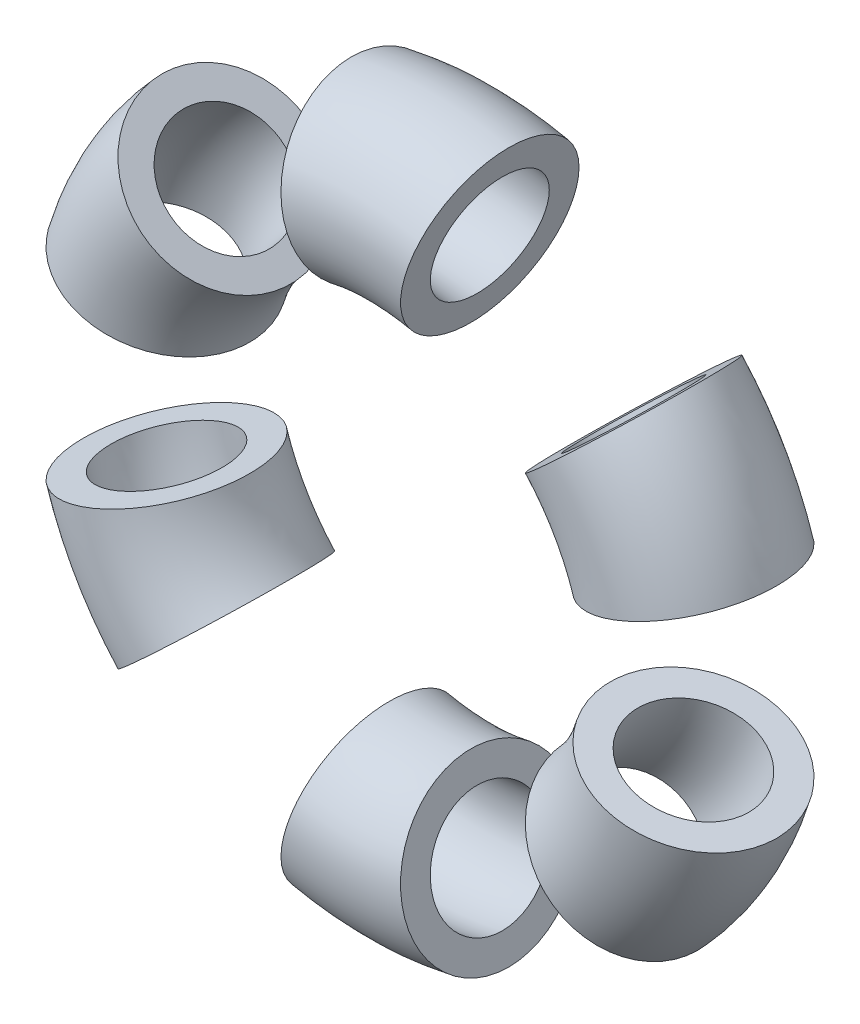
ISO-10303-21;
HEADER;
FILE_DESCRIPTION(('STEP AP214'),'2;1');
FILE_NAME('part.step','',(''),(''),'','','');
FILE_SCHEMA(('AUTOMOTIVE_DESIGN { 1 0 10303 214 1 1 1 1 }'));
ENDSEC;
DATA;
#1=APPLICATION_CONTEXT('core data for automotive mechanical design processes');
#2=APPLICATION_PROTOCOL_DEFINITION('international standard','automotive_design',2000,#1);
#3=PRODUCT_CONTEXT('',#1,'mechanical');
#4=PRODUCT('Part','Part','',(#3));
#5=PRODUCT_RELATED_PRODUCT_CATEGORY('part','',(#4));
#6=PRODUCT_DEFINITION_FORMATION('','',#4);
#7=PRODUCT_DEFINITION_CONTEXT('part definition',#1,'design');
#8=PRODUCT_DEFINITION('design','',#6,#7);
#9=PRODUCT_DEFINITION_SHAPE('','',#8);
#10=(LENGTH_UNIT() NAMED_UNIT(*) SI_UNIT(.MILLI.,.METRE.));
#11=(NAMED_UNIT(*) PLANE_ANGLE_UNIT() SI_UNIT($,.RADIAN.));
#12=(NAMED_UNIT(*) SI_UNIT($,.STERADIAN.) SOLID_ANGLE_UNIT());
#13=UNCERTAINTY_MEASURE_WITH_UNIT(LENGTH_MEASURE(1.E-05),#10,'distance_accuracy_value','');
#14=(GEOMETRIC_REPRESENTATION_CONTEXT(3) GLOBAL_UNCERTAINTY_ASSIGNED_CONTEXT((#13)) GLOBAL_UNIT_ASSIGNED_CONTEXT((#10,
#11,#12)) REPRESENTATION_CONTEXT('',''));
#15=CARTESIAN_POINT('',(0.,0.,0.));
#16=DIRECTION('',(0.,0.,1.));
#17=DIRECTION('',(1.,0.,0.));
#18=AXIS2_PLACEMENT_3D('',#15,#16,#17);
#19=CARTESIAN_POINT('',(0.,0.,0.));
#20=DIRECTION('',(0.,0.,1.));
#21=DIRECTION('',(0.50000000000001,0.866025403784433,0.));
#22=AXIS2_PLACEMENT_3D('',#19,#20,#21);
#23=TOROIDAL_SURFACE('',#22,9.5,2.);
#24=CARTESIAN_POINT('',(-7.0041346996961,6.41810697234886,0.));
#25=DIRECTION('',(0.675590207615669,0.737277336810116,0.));
#26=DIRECTION('',(0.,0.,-1.));
#27=AXIS2_PLACEMENT_3D('',#24,#25,#26);
#28=CIRCLE('',#27,2.);
#29=CARTESIAN_POINT('',(-8.47868937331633,7.76928738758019,0.));
#30=VERTEX_POINT('',#29);
#31=EDGE_CURVE('E47',#30,#30,#28,.T.);
#32=CARTESIAN_POINT('',(-9.06031103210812,2.8567050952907,0.));
#33=DIRECTION('',(0.300705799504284,0.953716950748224,0.));
#34=DIRECTION('',(0.,0.,-1.));
#35=AXIS2_PLACEMENT_3D('',#32,#33,#34);
#36=CIRCLE('',#35,2.);
#37=CARTESIAN_POINT('',(-10.9677449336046,3.45811669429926,0.));
#38=VERTEX_POINT('',#37);
#39=EDGE_CURVE('E55',#38,#38,#36,.T.);
#40=CARTESIAN_POINT('',(0.,0.,0.));
#41=DIRECTION('',(0.,0.,1.));
#42=DIRECTION('',(0.50000000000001,0.866025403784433,0.));
#43=AXIS2_PLACEMENT_3D('',#40,#41,#42);
#44=CIRCLE('',#43,11.5);
#45=EDGE_CURVE('',#30,#38,#44,.T.);
#46=ORIENTED_EDGE('',*,*,#31,.T.);
#47=ORIENTED_EDGE('',*,*,#39,.F.);
#48=ORIENTED_EDGE('',*,*,#45,.T.);
#49=ORIENTED_EDGE('',*,*,#45,.F.);
#50=EDGE_LOOP('',(#46,#48,#47,#49));
#51=FACE_BOUND('',#50,.T.);
#52=ADVANCED_FACE('F40',(#51),#23,.F.);
#53=CARTESIAN_POINT('',(0.,0.,0.));
#54=DIRECTION('',(0.,0.,1.));
#55=DIRECTION('',(0.50000000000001,0.866025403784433,0.));
#56=AXIS2_PLACEMENT_3D('',#53,#54,#55);
#57=TOROIDAL_SURFACE('',#56,9.5,3.);
#58=CARTESIAN_POINT('',(-7.0041346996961,6.41810697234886,0.));
#59=DIRECTION('',(0.675590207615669,0.737277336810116,0.));
#60=DIRECTION('',(0.,0.,-1.));
#61=AXIS2_PLACEMENT_3D('',#58,#59,#60);
#62=CIRCLE('',#61,3.);
#63=CARTESIAN_POINT('',(-9.21596671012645,8.44487759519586,0.));
#64=VERTEX_POINT('',#63);
#65=EDGE_CURVE('E11',#64,#64,#62,.T.);
#66=CARTESIAN_POINT('',(-9.06031103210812,2.8567050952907,0.));
#67=DIRECTION('',(0.300705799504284,0.953716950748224,0.));
#68=DIRECTION('',(0.,0.,-1.));
#69=AXIS2_PLACEMENT_3D('',#66,#67,#68);
#70=CIRCLE('',#69,3.);
#71=CARTESIAN_POINT('',(-11.9214618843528,3.75882249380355,0.));
#72=VERTEX_POINT('',#71);
#73=EDGE_CURVE('E51',#72,#72,#70,.T.);
#74=CARTESIAN_POINT('',(0.,0.,0.));
#75=DIRECTION('',(0.,0.,1.));
#76=DIRECTION('',(0.50000000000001,0.866025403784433,0.));
#77=AXIS2_PLACEMENT_3D('',#74,#75,#76);
#78=CIRCLE('',#77,12.5);
#79=EDGE_CURVE('',#64,#72,#78,.T.);
#80=ORIENTED_EDGE('',*,*,#65,.F.);
#81=ORIENTED_EDGE('',*,*,#73,.T.);
#82=ORIENTED_EDGE('',*,*,#79,.T.);
#83=ORIENTED_EDGE('',*,*,#79,.F.);
#84=EDGE_LOOP('',(#80,#82,#81,#83));
#85=FACE_BOUND('',#84,.T.);
#86=ADVANCED_FACE('F42',(#85),#57,.T.);
#87=CARTESIAN_POINT('',(-7.0041346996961,6.41810697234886,0.));
#88=DIRECTION('',(0.675590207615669,0.737277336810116,0.));
#89=DIRECTION('',(0.,0.,-1.));
#90=AXIS2_PLACEMENT_3D('',#87,#88,#89);
#91=PLANE('',#90);
#92=ORIENTED_EDGE('',*,*,#31,.F.);
#93=EDGE_LOOP('',(#92));
#94=FACE_BOUND('',#93,.T.);
#95=ORIENTED_EDGE('',*,*,#65,.T.);
#96=EDGE_LOOP('',(#95));
#97=FACE_BOUND('',#96,.T.);
#98=ADVANCED_FACE('F68',(#94,#97),#91,.T.);
#99=CARTESIAN_POINT('',(-9.06031103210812,2.8567050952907,0.));
#100=DIRECTION('',(0.300705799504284,0.953716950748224,0.));
#101=DIRECTION('',(0.,0.,-1.));
#102=AXIS2_PLACEMENT_3D('',#99,#100,#101);
#103=PLANE('',#102);
#104=ORIENTED_EDGE('',*,*,#39,.T.);
#105=EDGE_LOOP('',(#104));
#106=FACE_BOUND('',#105,.T.);
#107=ORIENTED_EDGE('',*,*,#73,.F.);
#108=EDGE_LOOP('',(#107));
#109=FACE_BOUND('',#108,.T.);
#110=ADVANCED_FACE('F61',(#106,#109),#103,.F.);
#111=CLOSED_SHELL('',(#52,#86,#98,#110));
#112=MANIFOLD_SOLID_BREP('B2',#111);
#113=CARTESIAN_POINT('',(0.,0.,0.));
#114=DIRECTION('',(0.,0.,1.));
#115=DIRECTION('',(-0.499999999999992,0.866025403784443,0.));
#116=AXIS2_PLACEMENT_3D('',#113,#114,#115);
#117=TOROIDAL_SURFACE('',#116,9.5,2.);
#118=CARTESIAN_POINT('',(-9.06031103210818,-2.85670509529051,0.));
#119=DIRECTION('',(-0.300705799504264,0.95371695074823,0.));
#120=DIRECTION('',(0.,0.,-1.));
#121=AXIS2_PLACEMENT_3D('',#118,#119,#120);
#122=CIRCLE('',#121,2.);
#123=CARTESIAN_POINT('',(-10.9677449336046,-3.45811669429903,0.));
#124=VERTEX_POINT('',#123);
#125=EDGE_CURVE('E117',#124,#124,#122,.T.);
#126=CARTESIAN_POINT('',(-7.00413469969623,-6.41810697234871,0.));
#127=DIRECTION('',(-0.675590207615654,0.73727733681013,0.));
#128=DIRECTION('',(0.,0.,-1.));
#129=AXIS2_PLACEMENT_3D('',#126,#127,#128);
#130=CIRCLE('',#129,2.);
#131=CARTESIAN_POINT('',(-8.47868937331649,-7.76928738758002,0.));
#132=VERTEX_POINT('',#131);
#133=EDGE_CURVE('E125',#132,#132,#130,.T.);
#134=CARTESIAN_POINT('',(0.,0.,0.));
#135=DIRECTION('',(0.,0.,1.));
#136=DIRECTION('',(-0.499999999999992,0.866025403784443,0.));
#137=AXIS2_PLACEMENT_3D('',#134,#135,#136);
#138=CIRCLE('',#137,11.5);
#139=EDGE_CURVE('',#124,#132,#138,.T.);
#140=ORIENTED_EDGE('',*,*,#125,.T.);
#141=ORIENTED_EDGE('',*,*,#133,.F.);
#142=ORIENTED_EDGE('',*,*,#139,.T.);
#143=ORIENTED_EDGE('',*,*,#139,.F.);
#144=EDGE_LOOP('',(#140,#142,#141,#143));
#145=FACE_BOUND('',#144,.T.);
#146=ADVANCED_FACE('F110',(#145),#117,.F.);
#147=CARTESIAN_POINT('',(0.,0.,0.));
#148=DIRECTION('',(0.,0.,1.));
#149=DIRECTION('',(-0.499999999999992,0.866025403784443,0.));
#150=AXIS2_PLACEMENT_3D('',#147,#148,#149);
#151=TOROIDAL_SURFACE('',#150,9.5,3.);
#152=CARTESIAN_POINT('',(-9.06031103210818,-2.85670509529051,0.));
#153=DIRECTION('',(-0.300705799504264,0.95371695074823,0.));
#154=DIRECTION('',(0.,0.,-1.));
#155=AXIS2_PLACEMENT_3D('',#152,#153,#154);
#156=CIRCLE('',#155,3.);
#157=CARTESIAN_POINT('',(-11.9214618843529,-3.7588224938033,0.));
#158=VERTEX_POINT('',#157);
#159=EDGE_CURVE('E39',#158,#158,#156,.T.);
#160=CARTESIAN_POINT('',(-7.00413469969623,-6.41810697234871,0.));
#161=DIRECTION('',(-0.675590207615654,0.73727733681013,0.));
#162=DIRECTION('',(0.,0.,-1.));
#163=AXIS2_PLACEMENT_3D('',#160,#161,#162);
#164=CIRCLE('',#163,3.);
#165=CARTESIAN_POINT('',(-9.21596671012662,-8.44487759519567,0.));
#166=VERTEX_POINT('',#165);
#167=EDGE_CURVE('E121',#166,#166,#164,.T.);
#168=CARTESIAN_POINT('',(0.,0.,0.));
#169=DIRECTION('',(0.,0.,1.));
#170=DIRECTION('',(-0.499999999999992,0.866025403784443,0.));
#171=AXIS2_PLACEMENT_3D('',#168,#169,#170);
#172=CIRCLE('',#171,12.5);
#173=EDGE_CURVE('',#158,#166,#172,.T.);
#174=ORIENTED_EDGE('',*,*,#159,.F.);
#175=ORIENTED_EDGE('',*,*,#167,.T.);
#176=ORIENTED_EDGE('',*,*,#173,.T.);
#177=ORIENTED_EDGE('',*,*,#173,.F.);
#178=EDGE_LOOP('',(#174,#176,#175,#177));
#179=FACE_BOUND('',#178,.T.);
#180=ADVANCED_FACE('F112',(#179),#151,.T.);
#181=CARTESIAN_POINT('',(-9.06031103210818,-2.85670509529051,0.));
#182=DIRECTION('',(-0.300705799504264,0.95371695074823,0.));
#183=DIRECTION('',(0.,0.,-1.));
#184=AXIS2_PLACEMENT_3D('',#181,#182,#183);
#185=PLANE('',#184);
#186=ORIENTED_EDGE('',*,*,#125,.F.);
#187=EDGE_LOOP('',(#186));
#188=FACE_BOUND('',#187,.T.);
#189=ORIENTED_EDGE('',*,*,#159,.T.);
#190=EDGE_LOOP('',(#189));
#191=FACE_BOUND('',#190,.T.);
#192=ADVANCED_FACE('F138',(#188,#191),#185,.T.);
#193=CARTESIAN_POINT('',(-7.00413469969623,-6.41810697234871,0.));
#194=DIRECTION('',(-0.675590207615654,0.73727733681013,0.));
#195=DIRECTION('',(0.,0.,-1.));
#196=AXIS2_PLACEMENT_3D('',#193,#194,#195);
#197=PLANE('',#196);
#198=ORIENTED_EDGE('',*,*,#133,.T.);
#199=EDGE_LOOP('',(#198));
#200=FACE_BOUND('',#199,.T.);
#201=ORIENTED_EDGE('',*,*,#167,.F.);
#202=EDGE_LOOP('',(#201));
#203=FACE_BOUND('',#202,.T.);
#204=ADVANCED_FACE('F131',(#200,#203),#197,.F.);
#205=CLOSED_SHELL('',(#146,#180,#192,#204));
#206=MANIFOLD_SOLID_BREP('B6',#205);
#207=CARTESIAN_POINT('',(0.,0.,0.));
#208=DIRECTION('',(0.,0.,1.));
#209=DIRECTION('',(-1.,0.,0.));
#210=AXIS2_PLACEMENT_3D('',#207,#208,#209);
#211=TOROIDAL_SURFACE('',#210,9.5,2.);
#212=CARTESIAN_POINT('',(-2.05617633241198,-9.27481206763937,0.));
#213=DIRECTION('',(-0.976296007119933,0.216439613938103,0.));
#214=DIRECTION('',(0.,0.,-1.));
#215=AXIS2_PLACEMENT_3D('',#212,#213,#214);
#216=CIRCLE('',#215,2.);
#217=CARTESIAN_POINT('',(-2.48905556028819,-11.2274040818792,0.));
#218=VERTEX_POINT('',#217);
#219=EDGE_CURVE('E187',#218,#218,#216,.T.);
#220=CARTESIAN_POINT('',(2.05617633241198,-9.27481206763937,0.));
#221=DIRECTION('',(-0.976296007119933,-0.216439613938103,0.));
#222=DIRECTION('',(0.,0.,-1.));
#223=AXIS2_PLACEMENT_3D('',#220,#221,#222);
#224=CIRCLE('',#223,2.);
#225=CARTESIAN_POINT('',(2.48905556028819,-11.2274040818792,0.));
#226=VERTEX_POINT('',#225);
#227=EDGE_CURVE('E195',#226,#226,#224,.T.);
#228=CARTESIAN_POINT('',(0.,0.,0.));
#229=DIRECTION('',(0.,0.,1.));
#230=DIRECTION('',(-1.,0.,0.));
#231=AXIS2_PLACEMENT_3D('',#228,#229,#230);
#232=CIRCLE('',#231,11.5);
#233=EDGE_CURVE('',#218,#226,#232,.T.);
#234=ORIENTED_EDGE('',*,*,#219,.T.);
#235=ORIENTED_EDGE('',*,*,#227,.F.);
#236=ORIENTED_EDGE('',*,*,#233,.T.);
#237=ORIENTED_EDGE('',*,*,#233,.F.);
#238=EDGE_LOOP('',(#234,#236,#235,#237));
#239=FACE_BOUND('',#238,.T.);
#240=ADVANCED_FACE('F180',(#239),#211,.F.);
#241=CARTESIAN_POINT('',(0.,0.,0.));
#242=DIRECTION('',(0.,0.,1.));
#243=DIRECTION('',(-1.,0.,0.));
#244=AXIS2_PLACEMENT_3D('',#241,#242,#243);
#245=TOROIDAL_SURFACE('',#244,9.5,3.);
#246=CARTESIAN_POINT('',(-2.05617633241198,-9.27481206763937,0.));
#247=DIRECTION('',(-0.976296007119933,0.216439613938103,0.));
#248=DIRECTION('',(0.,0.,-1.));
#249=AXIS2_PLACEMENT_3D('',#246,#247,#248);
#250=CIRCLE('',#249,3.);
#251=CARTESIAN_POINT('',(-2.70549517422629,-12.2037000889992,0.));
#252=VERTEX_POINT('',#251);
#253=EDGE_CURVE('E109',#252,#252,#250,.T.);
#254=CARTESIAN_POINT('',(2.05617633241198,-9.27481206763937,0.));
#255=DIRECTION('',(-0.976296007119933,-0.216439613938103,0.));
#256=DIRECTION('',(0.,0.,-1.));
#257=AXIS2_PLACEMENT_3D('',#254,#255,#256);
#258=CIRCLE('',#257,3.);
#259=CARTESIAN_POINT('',(2.70549517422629,-12.2037000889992,0.));
#260=VERTEX_POINT('',#259);
#261=EDGE_CURVE('E191',#260,#260,#258,.T.);
#262=CARTESIAN_POINT('',(0.,0.,0.));
#263=DIRECTION('',(0.,0.,1.));
#264=DIRECTION('',(-1.,0.,0.));
#265=AXIS2_PLACEMENT_3D('',#262,#263,#264);
#266=CIRCLE('',#265,12.5);
#267=EDGE_CURVE('',#252,#260,#266,.T.);
#268=ORIENTED_EDGE('',*,*,#253,.F.);
#269=ORIENTED_EDGE('',*,*,#261,.T.);
#270=ORIENTED_EDGE('',*,*,#267,.T.);
#271=ORIENTED_EDGE('',*,*,#267,.F.);
#272=EDGE_LOOP('',(#268,#270,#269,#271));
#273=FACE_BOUND('',#272,.T.);
#274=ADVANCED_FACE('F182',(#273),#245,.T.);
#275=CARTESIAN_POINT('',(-2.05617633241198,-9.27481206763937,0.));
#276=DIRECTION('',(-0.976296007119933,0.216439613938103,0.));
#277=DIRECTION('',(0.,0.,-1.));
#278=AXIS2_PLACEMENT_3D('',#275,#276,#277);
#279=PLANE('',#278);
#280=ORIENTED_EDGE('',*,*,#219,.F.);
#281=EDGE_LOOP('',(#280));
#282=FACE_BOUND('',#281,.T.);
#283=ORIENTED_EDGE('',*,*,#253,.T.);
#284=EDGE_LOOP('',(#283));
#285=FACE_BOUND('',#284,.T.);
#286=ADVANCED_FACE('F208',(#282,#285),#279,.T.);
#287=CARTESIAN_POINT('',(2.05617633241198,-9.27481206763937,0.));
#288=DIRECTION('',(-0.976296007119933,-0.216439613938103,0.));
#289=DIRECTION('',(0.,0.,-1.));
#290=AXIS2_PLACEMENT_3D('',#287,#288,#289);
#291=PLANE('',#290);
#292=ORIENTED_EDGE('',*,*,#227,.T.);
#293=EDGE_LOOP('',(#292));
#294=FACE_BOUND('',#293,.T.);
#295=ORIENTED_EDGE('',*,*,#261,.F.);
#296=EDGE_LOOP('',(#295));
#297=FACE_BOUND('',#296,.T.);
#298=ADVANCED_FACE('F201',(#294,#297),#291,.F.);
#299=CLOSED_SHELL('',(#240,#274,#286,#298));
#300=MANIFOLD_SOLID_BREP('B34',#299);
#301=CARTESIAN_POINT('',(0.,0.,0.));
#302=DIRECTION('',(0.,0.,1.));
#303=DIRECTION('',(-0.500000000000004,-0.866025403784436,0.));
#304=AXIS2_PLACEMENT_3D('',#301,#302,#303);
#305=TOROIDAL_SURFACE('',#304,9.5,2.);
#306=CARTESIAN_POINT('',(7.00413469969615,-6.41810697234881,0.));
#307=DIRECTION('',(-0.675590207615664,-0.737277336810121,0.));
#308=DIRECTION('',(0.,0.,-1.));
#309=AXIS2_PLACEMENT_3D('',#306,#307,#308);
#310=CIRCLE('',#309,2.);
#311=CARTESIAN_POINT('',(8.47868937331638,-7.76928738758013,0.));
#312=VERTEX_POINT('',#311);
#313=EDGE_CURVE('E257',#312,#312,#310,.T.);
#314=CARTESIAN_POINT('',(9.06031103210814,-2.85670509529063,0.));
#315=DIRECTION('',(-0.300705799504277,-0.953716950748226,0.));
#316=DIRECTION('',(0.,0.,-1.));
#317=AXIS2_PLACEMENT_3D('',#314,#315,#316);
#318=CIRCLE('',#317,2.);
#319=CARTESIAN_POINT('',(10.9677449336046,-3.45811669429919,0.));
#320=VERTEX_POINT('',#319);
#321=EDGE_CURVE('E265',#320,#320,#318,.T.);
#322=CARTESIAN_POINT('',(0.,0.,0.));
#323=DIRECTION('',(0.,0.,1.));
#324=DIRECTION('',(-0.500000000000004,-0.866025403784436,0.));
#325=AXIS2_PLACEMENT_3D('',#322,#323,#324);
#326=CIRCLE('',#325,11.5);
#327=EDGE_CURVE('',#312,#320,#326,.T.);
#328=ORIENTED_EDGE('',*,*,#313,.T.);
#329=ORIENTED_EDGE('',*,*,#321,.F.);
#330=ORIENTED_EDGE('',*,*,#327,.T.);
#331=ORIENTED_EDGE('',*,*,#327,.F.);
#332=EDGE_LOOP('',(#328,#330,#329,#331));
#333=FACE_BOUND('',#332,.T.);
#334=ADVANCED_FACE('F250',(#333),#305,.F.);
#335=CARTESIAN_POINT('',(0.,0.,0.));
#336=DIRECTION('',(0.,0.,1.));
#337=DIRECTION('',(-0.500000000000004,-0.866025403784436,0.));
#338=AXIS2_PLACEMENT_3D('',#335,#336,#337);
#339=TOROIDAL_SURFACE('',#338,9.5,3.);
#340=CARTESIAN_POINT('',(7.00413469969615,-6.41810697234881,0.));
#341=DIRECTION('',(-0.675590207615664,-0.737277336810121,0.));
#342=DIRECTION('',(0.,0.,-1.));
#343=AXIS2_PLACEMENT_3D('',#340,#341,#342);
#344=CIRCLE('',#343,3.);
#345=CARTESIAN_POINT('',(9.21596671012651,-8.4448775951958,0.));
#346=VERTEX_POINT('',#345);
#347=EDGE_CURVE('E179',#346,#346,#344,.T.);
#348=CARTESIAN_POINT('',(9.06031103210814,-2.85670509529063,0.));
#349=DIRECTION('',(-0.300705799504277,-0.953716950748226,0.));
#350=DIRECTION('',(0.,0.,-1.));
#351=AXIS2_PLACEMENT_3D('',#348,#349,#350);
#352=CIRCLE('',#351,3.);
#353=CARTESIAN_POINT('',(11.9214618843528,-3.75882249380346,0.));
#354=VERTEX_POINT('',#353);
#355=EDGE_CURVE('E261',#354,#354,#352,.T.);
#356=CARTESIAN_POINT('',(0.,0.,0.));
#357=DIRECTION('',(0.,0.,1.));
#358=DIRECTION('',(-0.500000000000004,-0.866025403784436,0.));
#359=AXIS2_PLACEMENT_3D('',#356,#357,#358);
#360=CIRCLE('',#359,12.5);
#361=EDGE_CURVE('',#346,#354,#360,.T.);
#362=ORIENTED_EDGE('',*,*,#347,.F.);
#363=ORIENTED_EDGE('',*,*,#355,.T.);
#364=ORIENTED_EDGE('',*,*,#361,.T.);
#365=ORIENTED_EDGE('',*,*,#361,.F.);
#366=EDGE_LOOP('',(#362,#364,#363,#365));
#367=FACE_BOUND('',#366,.T.);
#368=ADVANCED_FACE('F252',(#367),#339,.T.);
#369=CARTESIAN_POINT('',(7.00413469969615,-6.41810697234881,0.));
#370=DIRECTION('',(-0.675590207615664,-0.737277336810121,0.));
#371=DIRECTION('',(0.,0.,-1.));
#372=AXIS2_PLACEMENT_3D('',#369,#370,#371);
#373=PLANE('',#372);
#374=ORIENTED_EDGE('',*,*,#313,.F.);
#375=EDGE_LOOP('',(#374));
#376=FACE_BOUND('',#375,.T.);
#377=ORIENTED_EDGE('',*,*,#347,.T.);
#378=EDGE_LOOP('',(#377));
#379=FACE_BOUND('',#378,.T.);
#380=ADVANCED_FACE('F278',(#376,#379),#373,.T.);
#381=CARTESIAN_POINT('',(9.06031103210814,-2.85670509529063,0.));
#382=DIRECTION('',(-0.300705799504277,-0.953716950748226,0.));
#383=DIRECTION('',(0.,0.,-1.));
#384=AXIS2_PLACEMENT_3D('',#381,#382,#383);
#385=PLANE('',#384);
#386=ORIENTED_EDGE('',*,*,#321,.T.);
#387=EDGE_LOOP('',(#386));
#388=FACE_BOUND('',#387,.T.);
#389=ORIENTED_EDGE('',*,*,#355,.F.);
#390=EDGE_LOOP('',(#389));
#391=FACE_BOUND('',#390,.T.);
#392=ADVANCED_FACE('F271',(#388,#391),#385,.F.);
#393=CLOSED_SHELL('',(#334,#368,#380,#392));
#394=MANIFOLD_SOLID_BREP('B104',#393);
#395=CARTESIAN_POINT('',(0.,0.,0.));
#396=DIRECTION('',(0.,0.,1.));
#397=DIRECTION('',(0.499999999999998,-0.86602540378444,0.));
#398=AXIS2_PLACEMENT_3D('',#395,#396,#397);
#399=TOROIDAL_SURFACE('',#398,9.5,2.);
#400=CARTESIAN_POINT('',(9.06031103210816,2.85670509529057,0.));
#401=DIRECTION('',(0.300705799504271,-0.953716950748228,0.));
#402=DIRECTION('',(0.,0.,-1.));
#403=AXIS2_PLACEMENT_3D('',#400,#401,#402);
#404=CIRCLE('',#403,2.);
#405=CARTESIAN_POINT('',(10.9677449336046,3.45811669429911,0.));
#406=VERTEX_POINT('',#405);
#407=EDGE_CURVE('E326',#406,#406,#404,.T.);
#408=CARTESIAN_POINT('',(7.00413469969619,6.41810697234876,0.));
#409=DIRECTION('',(0.675590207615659,-0.737277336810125,0.));
#410=DIRECTION('',(0.,0.,-1.));
#411=AXIS2_PLACEMENT_3D('',#408,#409,#410);
#412=CIRCLE('',#411,2.);
#413=CARTESIAN_POINT('',(8.47868937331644,7.76928738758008,0.));
#414=VERTEX_POINT('',#413);
#415=EDGE_CURVE('E334',#414,#414,#412,.T.);
#416=CARTESIAN_POINT('',(0.,0.,0.));
#417=DIRECTION('',(0.,0.,1.));
#418=DIRECTION('',(0.499999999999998,-0.86602540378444,0.));
#419=AXIS2_PLACEMENT_3D('',#416,#417,#418);
#420=CIRCLE('',#419,11.5);
#421=EDGE_CURVE('',#406,#414,#420,.T.);
#422=ORIENTED_EDGE('',*,*,#407,.T.);
#423=ORIENTED_EDGE('',*,*,#415,.F.);
#424=ORIENTED_EDGE('',*,*,#421,.T.);
#425=ORIENTED_EDGE('',*,*,#421,.F.);
#426=EDGE_LOOP('',(#422,#424,#423,#425));
#427=FACE_BOUND('',#426,.T.);
#428=ADVANCED_FACE('F319',(#427),#399,.F.);
#429=CARTESIAN_POINT('',(0.,0.,0.));
#430=DIRECTION('',(0.,0.,1.));
#431=DIRECTION('',(0.499999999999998,-0.86602540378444,0.));
#432=AXIS2_PLACEMENT_3D('',#429,#430,#431);
#433=TOROIDAL_SURFACE('',#432,9.5,3.);
#434=CARTESIAN_POINT('',(9.06031103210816,2.85670509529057,0.));
#435=DIRECTION('',(0.300705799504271,-0.953716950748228,0.));
#436=DIRECTION('',(0.,0.,-1.));
#437=AXIS2_PLACEMENT_3D('',#434,#435,#436);
#438=CIRCLE('',#437,3.);
#439=CARTESIAN_POINT('',(11.9214618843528,3.75882249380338,0.));
#440=VERTEX_POINT('',#439);
#441=EDGE_CURVE('E249',#440,#440,#438,.T.);
#442=CARTESIAN_POINT('',(7.00413469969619,6.41810697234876,0.));
#443=DIRECTION('',(0.675590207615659,-0.737277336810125,0.));
#444=DIRECTION('',(0.,0.,-1.));
#445=AXIS2_PLACEMENT_3D('',#442,#443,#444);
#446=CIRCLE('',#445,3.);
#447=CARTESIAN_POINT('',(9.21596671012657,8.44487759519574,0.));
#448=VERTEX_POINT('',#447);
#449=EDGE_CURVE('E330',#448,#448,#446,.T.);
#450=CARTESIAN_POINT('',(0.,0.,0.));
#451=DIRECTION('',(0.,0.,1.));
#452=DIRECTION('',(0.499999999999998,-0.86602540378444,0.));
#453=AXIS2_PLACEMENT_3D('',#450,#451,#452);
#454=CIRCLE('',#453,12.5);
#455=EDGE_CURVE('',#440,#448,#454,.T.);
#456=ORIENTED_EDGE('',*,*,#441,.F.);
#457=ORIENTED_EDGE('',*,*,#449,.T.);
#458=ORIENTED_EDGE('',*,*,#455,.T.);
#459=ORIENTED_EDGE('',*,*,#455,.F.);
#460=EDGE_LOOP('',(#456,#458,#457,#459));
#461=FACE_BOUND('',#460,.T.);
#462=ADVANCED_FACE('F321',(#461),#433,.T.);
#463=CARTESIAN_POINT('',(9.06031103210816,2.85670509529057,0.));
#464=DIRECTION('',(0.300705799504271,-0.953716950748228,0.));
#465=DIRECTION('',(0.,0.,-1.));
#466=AXIS2_PLACEMENT_3D('',#463,#464,#465);
#467=PLANE('',#466);
#468=ORIENTED_EDGE('',*,*,#407,.F.);
#469=EDGE_LOOP('',(#468));
#470=FACE_BOUND('',#469,.T.);
#471=ORIENTED_EDGE('',*,*,#441,.T.);
#472=EDGE_LOOP('',(#471));
#473=FACE_BOUND('',#472,.T.);
#474=ADVANCED_FACE('F347',(#470,#473),#467,.T.);
#475=CARTESIAN_POINT('',(7.00413469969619,6.41810697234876,0.));
#476=DIRECTION('',(0.675590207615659,-0.737277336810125,0.));
#477=DIRECTION('',(0.,0.,-1.));
#478=AXIS2_PLACEMENT_3D('',#475,#476,#477);
#479=PLANE('',#478);
#480=ORIENTED_EDGE('',*,*,#415,.T.);
#481=EDGE_LOOP('',(#480));
#482=FACE_BOUND('',#481,.T.);
#483=ORIENTED_EDGE('',*,*,#449,.F.);
#484=EDGE_LOOP('',(#483));
#485=FACE_BOUND('',#484,.T.);
#486=ADVANCED_FACE('F340',(#482,#485),#479,.F.);
#487=CLOSED_SHELL('',(#428,#462,#474,#486));
#488=MANIFOLD_SOLID_BREP('B174',#487);
#489=CARTESIAN_POINT('',(0.,0.,0.));
#490=DIRECTION('',(0.,0.,1.));
#491=DIRECTION('',(1.,0.,0.));
#492=AXIS2_PLACEMENT_3D('',#489,#490,#491);
#493=TOROIDAL_SURFACE('',#492,9.5,2.);
#494=CARTESIAN_POINT('',(2.05617633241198,9.27481206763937,0.));
#495=DIRECTION('',(0.976296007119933,-0.216439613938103,0.));
#496=DIRECTION('',(0.,0.,-1.));
#497=AXIS2_PLACEMENT_3D('',#494,#495,#496);
#498=CIRCLE('',#497,2.);
#499=CARTESIAN_POINT('',(2.48905556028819,11.2274040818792,0.));
#500=VERTEX_POINT('',#499);
#501=EDGE_CURVE('E388',#500,#500,#498,.T.);
#502=CARTESIAN_POINT('',(-2.05617633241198,9.27481206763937,0.));
#503=DIRECTION('',(0.976296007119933,0.216439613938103,0.));
#504=DIRECTION('',(0.,0.,-1.));
#505=AXIS2_PLACEMENT_3D('',#502,#503,#504);
#506=CIRCLE('',#505,2.);
#507=CARTESIAN_POINT('',(-2.48905556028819,11.2274040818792,0.));
#508=VERTEX_POINT('',#507);
#509=EDGE_CURVE('E396',#508,#508,#506,.T.);
#510=CARTESIAN_POINT('',(0.,0.,0.));
#511=DIRECTION('',(0.,0.,1.));
#512=DIRECTION('',(1.,0.,0.));
#513=AXIS2_PLACEMENT_3D('',#510,#511,#512);
#514=CIRCLE('',#513,11.5);
#515=EDGE_CURVE('',#500,#508,#514,.T.);
#516=ORIENTED_EDGE('',*,*,#501,.T.);
#517=ORIENTED_EDGE('',*,*,#509,.F.);
#518=ORIENTED_EDGE('',*,*,#515,.T.);
#519=ORIENTED_EDGE('',*,*,#515,.F.);
#520=EDGE_LOOP('',(#516,#518,#517,#519));
#521=FACE_BOUND('',#520,.T.);
#522=ADVANCED_FACE('F381',(#521),#493,.F.);
#523=CARTESIAN_POINT('',(0.,0.,0.));
#524=DIRECTION('',(0.,0.,1.));
#525=DIRECTION('',(1.,0.,0.));
#526=AXIS2_PLACEMENT_3D('',#523,#524,#525);
#527=TOROIDAL_SURFACE('',#526,9.5,3.);
#528=CARTESIAN_POINT('',(2.05617633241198,9.27481206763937,0.));
#529=DIRECTION('',(0.976296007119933,-0.216439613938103,0.));
#530=DIRECTION('',(0.,0.,-1.));
#531=AXIS2_PLACEMENT_3D('',#528,#529,#530);
#532=CIRCLE('',#531,3.);
#533=CARTESIAN_POINT('',(2.70549517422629,12.2037000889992,0.));
#534=VERTEX_POINT('',#533);
#535=EDGE_CURVE('E318',#534,#534,#532,.T.);
#536=CARTESIAN_POINT('',(-2.05617633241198,9.27481206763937,0.));
#537=DIRECTION('',(0.976296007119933,0.216439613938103,0.));
#538=DIRECTION('',(0.,0.,-1.));
#539=AXIS2_PLACEMENT_3D('',#536,#537,#538);
#540=CIRCLE('',#539,3.);
#541=CARTESIAN_POINT('',(-2.70549517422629,12.2037000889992,0.));
#542=VERTEX_POINT('',#541);
#543=EDGE_CURVE('E392',#542,#542,#540,.T.);
#544=CARTESIAN_POINT('',(0.,0.,0.));
#545=DIRECTION('',(0.,0.,1.));
#546=DIRECTION('',(1.,0.,0.));
#547=AXIS2_PLACEMENT_3D('',#544,#545,#546);
#548=CIRCLE('',#547,12.5);
#549=EDGE_CURVE('',#534,#542,#548,.T.);
#550=ORIENTED_EDGE('',*,*,#535,.F.);
#551=ORIENTED_EDGE('',*,*,#543,.T.);
#552=ORIENTED_EDGE('',*,*,#549,.T.);
#553=ORIENTED_EDGE('',*,*,#549,.F.);
#554=EDGE_LOOP('',(#550,#552,#551,#553));
#555=FACE_BOUND('',#554,.T.);
#556=ADVANCED_FACE('F383',(#555),#527,.T.);
#557=CARTESIAN_POINT('',(2.05617633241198,9.27481206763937,0.));
#558=DIRECTION('',(0.976296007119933,-0.216439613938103,0.));
#559=DIRECTION('',(0.,0.,-1.));
#560=AXIS2_PLACEMENT_3D('',#557,#558,#559);
#561=PLANE('',#560);
#562=ORIENTED_EDGE('',*,*,#501,.F.);
#563=EDGE_LOOP('',(#562));
#564=FACE_BOUND('',#563,.T.);
#565=ORIENTED_EDGE('',*,*,#535,.T.);
#566=EDGE_LOOP('',(#565));
#567=FACE_BOUND('',#566,.T.);
#568=ADVANCED_FACE('F409',(#564,#567),#561,.T.);
#569=CARTESIAN_POINT('',(-2.05617633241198,9.27481206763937,0.));
#570=DIRECTION('',(0.976296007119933,0.216439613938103,0.));
#571=DIRECTION('',(0.,0.,-1.));
#572=AXIS2_PLACEMENT_3D('',#569,#570,#571);
#573=PLANE('',#572);
#574=ORIENTED_EDGE('',*,*,#509,.T.);
#575=EDGE_LOOP('',(#574));
#576=FACE_BOUND('',#575,.T.);
#577=ORIENTED_EDGE('',*,*,#543,.F.);
#578=EDGE_LOOP('',(#577));
#579=FACE_BOUND('',#578,.T.);
#580=ADVANCED_FACE('F402',(#576,#579),#573,.F.);
#581=CLOSED_SHELL('',(#522,#556,#568,#580));
#582=MANIFOLD_SOLID_BREP('B244',#581);
#583=ADVANCED_BREP_SHAPE_REPRESENTATION('',(#18,#112,#206,#300,#394,#488,#582),#14);
#584=SHAPE_DEFINITION_REPRESENTATION(#9,#583);
ENDSEC;
END-ISO-10303-21;
